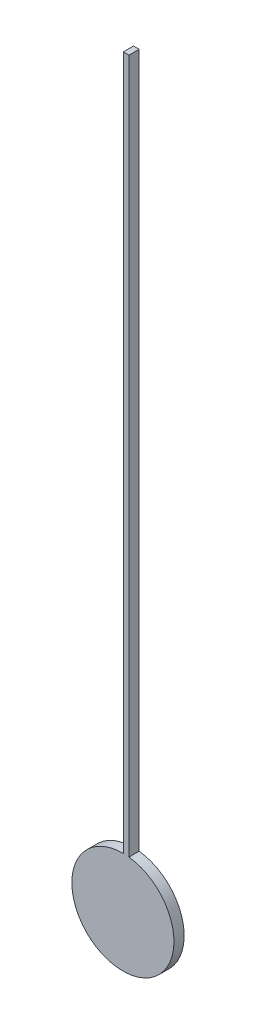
ISO-10303-21;
HEADER;
FILE_DESCRIPTION(('STEP AP214'),'2;1');
FILE_NAME('part.step','',(''),(''),'','','');
FILE_SCHEMA(('AUTOMOTIVE_DESIGN { 1 0 10303 214 1 1 1 1 }'));
ENDSEC;
DATA;
#1=APPLICATION_CONTEXT('core data for automotive mechanical design processes');
#2=APPLICATION_PROTOCOL_DEFINITION('international standard','automotive_design',2000,#1);
#3=PRODUCT_CONTEXT('',#1,'mechanical');
#4=PRODUCT('Part','Part','',(#3));
#5=PRODUCT_RELATED_PRODUCT_CATEGORY('part','',(#4));
#6=PRODUCT_DEFINITION_FORMATION('','',#4);
#7=PRODUCT_DEFINITION_CONTEXT('part definition',#1,'design');
#8=PRODUCT_DEFINITION('design','',#6,#7);
#9=PRODUCT_DEFINITION_SHAPE('','',#8);
#10=(LENGTH_UNIT() NAMED_UNIT(*) SI_UNIT(.MILLI.,.METRE.));
#11=(NAMED_UNIT(*) PLANE_ANGLE_UNIT() SI_UNIT($,.RADIAN.));
#12=(NAMED_UNIT(*) SI_UNIT($,.STERADIAN.) SOLID_ANGLE_UNIT());
#13=UNCERTAINTY_MEASURE_WITH_UNIT(LENGTH_MEASURE(1.E-05),#10,'distance_accuracy_value','');
#14=(GEOMETRIC_REPRESENTATION_CONTEXT(3) GLOBAL_UNCERTAINTY_ASSIGNED_CONTEXT((#13)) GLOBAL_UNIT_ASSIGNED_CONTEXT((#10,
#11,#12)) REPRESENTATION_CONTEXT('',''));
#15=CARTESIAN_POINT('',(0.,0.,0.));
#16=DIRECTION('',(0.,0.,1.));
#17=DIRECTION('',(1.,0.,0.));
#18=AXIS2_PLACEMENT_3D('',#15,#16,#17);
#19=CARTESIAN_POINT('',(0.592712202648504,4.96474493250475,1.));
#20=DIRECTION('',(-1.,0.,0.));
#21=DIRECTION('',(0.,0.,1.));
#22=AXIS2_PLACEMENT_3D('',#19,#20,#21);
#23=PLANE('',#22);
#24=DIRECTION('',(0.,1.,0.));
#25=VECTOR('',#24,1.);
#26=CARTESIAN_POINT('',(0.592712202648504,4.96474493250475,0.));
#27=LINE('',#26,#25);
#28=CARTESIAN_POINT('',(0.592712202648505,4.96474493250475,0.));
#29=VERTEX_POINT('',#28);
#30=CARTESIAN_POINT('',(0.592712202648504,72.9845522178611,0.));
#31=VERTEX_POINT('',#30);
#32=EDGE_CURVE('E96',#29,#31,#27,.T.);
#33=ORIENTED_EDGE('',*,*,#32,.T.);
#34=DIRECTION('',(0.,0.,-1.));
#35=VECTOR('',#34,1.);
#36=CARTESIAN_POINT('',(0.592712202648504,72.9845522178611,1.));
#37=LINE('',#36,#35);
#38=CARTESIAN_POINT('',(0.592712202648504,72.9845522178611,1.));
#39=VERTEX_POINT('',#38);
#40=EDGE_CURVE('E11',#39,#31,#37,.T.);
#41=ORIENTED_EDGE('',*,*,#40,.F.);
#42=DIRECTION('',(0.,1.,0.));
#43=VECTOR('',#42,1.);
#44=CARTESIAN_POINT('',(0.592712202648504,4.96474493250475,1.));
#45=LINE('',#44,#43);
#46=CARTESIAN_POINT('',(0.592712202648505,4.96474493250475,1.));
#47=VERTEX_POINT('',#46);
#48=EDGE_CURVE('E84',#47,#39,#45,.T.);
#49=ORIENTED_EDGE('',*,*,#48,.F.);
#50=DIRECTION('',(0.,0.,-1.));
#51=VECTOR('',#50,1.);
#52=CARTESIAN_POINT('',(0.592712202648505,4.96474493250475,1.));
#53=LINE('',#52,#51);
#54=EDGE_CURVE('E92',#47,#29,#53,.T.);
#55=ORIENTED_EDGE('',*,*,#54,.T.);
#56=EDGE_LOOP('',(#33,#41,#49,#55));
#57=FACE_BOUND('',#56,.T.);
#58=ADVANCED_FACE('F33',(#57),#23,.F.);
#59=CARTESIAN_POINT('',(0.0382730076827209,72.9845522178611,1.));
#60=DIRECTION('',(0.,-1.,0.));
#61=DIRECTION('',(0.,0.,-1.));
#62=AXIS2_PLACEMENT_3D('',#59,#60,#61);
#63=PLANE('',#62);
#64=DIRECTION('',(-1.,0.,0.));
#65=VECTOR('',#64,1.);
#66=CARTESIAN_POINT('',(0.0382730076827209,72.9845522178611,0.));
#67=LINE('',#66,#65);
#68=CARTESIAN_POINT('',(0.0382730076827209,72.9845522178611,0.));
#69=VERTEX_POINT('',#68);
#70=EDGE_CURVE('E88',#31,#69,#67,.T.);
#71=ORIENTED_EDGE('',*,*,#70,.T.);
#72=DIRECTION('',(0.,0.,-1.));
#73=VECTOR('',#72,1.);
#74=CARTESIAN_POINT('',(0.0382730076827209,72.9845522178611,1.));
#75=LINE('',#74,#73);
#76=CARTESIAN_POINT('',(0.0382730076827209,72.9845522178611,1.));
#77=VERTEX_POINT('',#76);
#78=EDGE_CURVE('E41',#77,#69,#75,.T.);
#79=ORIENTED_EDGE('',*,*,#78,.F.);
#80=DIRECTION('',(-1.,0.,0.));
#81=VECTOR('',#80,1.);
#82=CARTESIAN_POINT('',(0.0382730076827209,72.9845522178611,1.));
#83=LINE('',#82,#81);
#84=EDGE_CURVE('E79',#39,#77,#83,.T.);
#85=ORIENTED_EDGE('',*,*,#84,.F.);
#86=ORIENTED_EDGE('',*,*,#40,.T.);
#87=EDGE_LOOP('',(#71,#79,#85,#86));
#88=FACE_BOUND('',#87,.T.);
#89=ADVANCED_FACE('F87',(#88),#63,.F.);
#90=CARTESIAN_POINT('',(0.0382730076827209,4.99985351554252,1.));
#91=DIRECTION('',(1.,0.,0.));
#92=DIRECTION('',(0.,0.,-1.));
#93=AXIS2_PLACEMENT_3D('',#90,#91,#92);
#94=PLANE('',#93);
#95=DIRECTION('',(0.,-1.,0.));
#96=VECTOR('',#95,1.);
#97=CARTESIAN_POINT('',(0.0382730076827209,4.99985351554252,0.));
#98=LINE('',#97,#96);
#99=CARTESIAN_POINT('',(0.0382730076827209,4.99985351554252,0.));
#100=VERTEX_POINT('',#99);
#101=EDGE_CURVE('E66',#69,#100,#98,.T.);
#102=ORIENTED_EDGE('',*,*,#101,.T.);
#103=DIRECTION('',(0.,0.,-1.));
#104=VECTOR('',#103,1.);
#105=CARTESIAN_POINT('',(0.0382730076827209,4.99985351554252,1.));
#106=LINE('',#105,#104);
#107=CARTESIAN_POINT('',(0.0382730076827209,4.99985351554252,1.));
#108=VERTEX_POINT('',#107);
#109=EDGE_CURVE('E89',#108,#100,#106,.T.);
#110=ORIENTED_EDGE('',*,*,#109,.F.);
#111=DIRECTION('',(0.,-1.,0.));
#112=VECTOR('',#111,1.);
#113=CARTESIAN_POINT('',(0.0382730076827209,4.99985351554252,1.));
#114=LINE('',#113,#112);
#115=EDGE_CURVE('E82',#77,#108,#114,.T.);
#116=ORIENTED_EDGE('',*,*,#115,.F.);
#117=ORIENTED_EDGE('',*,*,#78,.T.);
#118=EDGE_LOOP('',(#102,#110,#116,#117));
#119=FACE_BOUND('',#118,.T.);
#120=ADVANCED_FACE('F90',(#119),#94,.F.);
#121=CARTESIAN_POINT('',(0.,0.,1.));
#122=DIRECTION('',(0.,0.,-1.));
#123=DIRECTION('',(-1.,0.,0.));
#124=AXIS2_PLACEMENT_3D('',#121,#122,#123);
#125=CYLINDRICAL_SURFACE('',#124,5.);
#126=CARTESIAN_POINT('',(0.,0.,0.));
#127=DIRECTION('',(0.,0.,1.));
#128=DIRECTION('',(1.,0.,0.));
#129=AXIS2_PLACEMENT_3D('',#126,#127,#128);
#130=CIRCLE('',#129,5.);
#131=EDGE_CURVE('E72',#100,#29,#130,.T.);
#132=ORIENTED_EDGE('',*,*,#131,.T.);
#133=ORIENTED_EDGE('',*,*,#54,.F.);
#134=CARTESIAN_POINT('',(0.,0.,1.));
#135=DIRECTION('',(0.,0.,1.));
#136=DIRECTION('',(1.,0.,0.));
#137=AXIS2_PLACEMENT_3D('',#134,#135,#136);
#138=CIRCLE('',#137,5.);
#139=EDGE_CURVE('E49',#108,#47,#138,.T.);
#140=ORIENTED_EDGE('',*,*,#139,.F.);
#141=ORIENTED_EDGE('',*,*,#109,.T.);
#142=EDGE_LOOP('',(#132,#133,#140,#141));
#143=FACE_BOUND('',#142,.T.);
#144=ADVANCED_FACE('F103',(#143),#125,.T.);
#145=CARTESIAN_POINT('',(0.,0.,1.));
#146=DIRECTION('',(0.,0.,1.));
#147=DIRECTION('',(1.,0.,0.));
#148=AXIS2_PLACEMENT_3D('',#145,#146,#147);
#149=PLANE('',#148);
#150=ORIENTED_EDGE('',*,*,#48,.T.);
#151=ORIENTED_EDGE('',*,*,#84,.T.);
#152=ORIENTED_EDGE('',*,*,#115,.T.);
#153=ORIENTED_EDGE('',*,*,#139,.T.);
#154=EDGE_LOOP('',(#150,#151,#152,#153));
#155=FACE_BOUND('',#154,.T.);
#156=ADVANCED_FACE('F80',(#155),#149,.T.);
#157=CARTESIAN_POINT('',(0.,0.,0.));
#158=DIRECTION('',(0.,0.,1.));
#159=DIRECTION('',(1.,0.,0.));
#160=AXIS2_PLACEMENT_3D('',#157,#158,#159);
#161=PLANE('',#160);
#162=ORIENTED_EDGE('',*,*,#32,.F.);
#163=ORIENTED_EDGE('',*,*,#131,.F.);
#164=ORIENTED_EDGE('',*,*,#101,.F.);
#165=ORIENTED_EDGE('',*,*,#70,.F.);
#166=EDGE_LOOP('',(#162,#163,#164,#165));
#167=FACE_BOUND('',#166,.T.);
#168=ADVANCED_FACE('F106',(#167),#161,.F.);
#169=CLOSED_SHELL('',(#58,#89,#120,#144,#156,#168));
#170=MANIFOLD_SOLID_BREP('B2',#169);
#171=ADVANCED_BREP_SHAPE_REPRESENTATION('',(#18,#170),#14);
#172=SHAPE_DEFINITION_REPRESENTATION(#9,#171);
ENDSEC;
END-ISO-10303-21;
